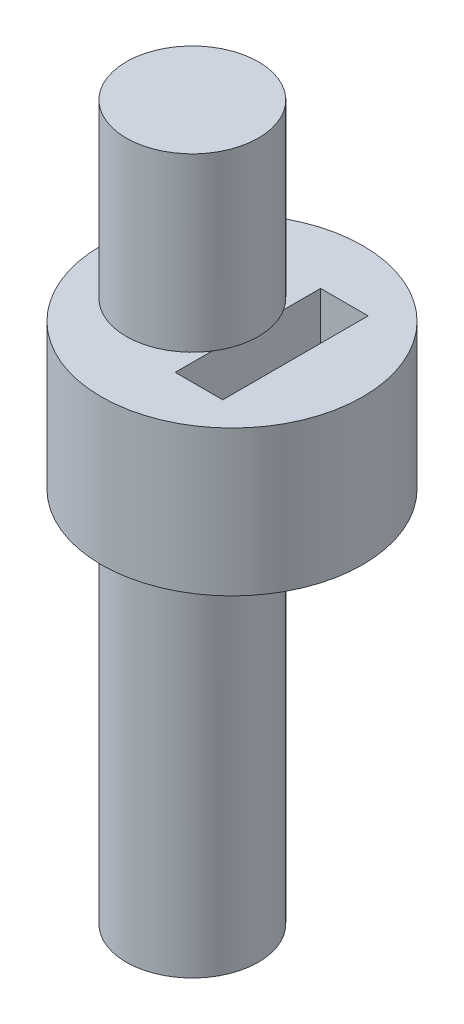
ISO-10303-21;
HEADER;
FILE_DESCRIPTION(('STEP AP214'),'2;1');
FILE_NAME('part.step','',(''),(''),'','','');
FILE_SCHEMA(('AUTOMOTIVE_DESIGN { 1 0 10303 214 1 1 1 1 }'));
ENDSEC;
DATA;
#1=APPLICATION_CONTEXT('core data for automotive mechanical design processes');
#2=APPLICATION_PROTOCOL_DEFINITION('international standard','automotive_design',2000,#1);
#3=PRODUCT_CONTEXT('',#1,'mechanical');
#4=PRODUCT('Part','Part','',(#3));
#5=PRODUCT_RELATED_PRODUCT_CATEGORY('part','',(#4));
#6=PRODUCT_DEFINITION_FORMATION('','',#4);
#7=PRODUCT_DEFINITION_CONTEXT('part definition',#1,'design');
#8=PRODUCT_DEFINITION('design','',#6,#7);
#9=PRODUCT_DEFINITION_SHAPE('','',#8);
#10=(LENGTH_UNIT() NAMED_UNIT(*) SI_UNIT(.MILLI.,.METRE.));
#11=(NAMED_UNIT(*) PLANE_ANGLE_UNIT() SI_UNIT($,.RADIAN.));
#12=(NAMED_UNIT(*) SI_UNIT($,.STERADIAN.) SOLID_ANGLE_UNIT());
#13=UNCERTAINTY_MEASURE_WITH_UNIT(LENGTH_MEASURE(1.E-05),#10,'distance_accuracy_value','');
#14=(GEOMETRIC_REPRESENTATION_CONTEXT(3) GLOBAL_UNCERTAINTY_ASSIGNED_CONTEXT((#13)) GLOBAL_UNIT_ASSIGNED_CONTEXT((#10,
#11,#12)) REPRESENTATION_CONTEXT('',''));
#15=CARTESIAN_POINT('',(0.,0.,0.));
#16=DIRECTION('',(0.,0.,1.));
#17=DIRECTION('',(1.,0.,0.));
#18=AXIS2_PLACEMENT_3D('',#15,#16,#17);
#19=CARTESIAN_POINT('',(0.,15.,0.));
#20=DIRECTION('',(0.,-1.,0.));
#21=DIRECTION('',(0.,0.,-1.));
#22=AXIS2_PLACEMENT_3D('',#19,#20,#21);
#23=CYLINDRICAL_SURFACE('',#22,2.5);
#24=CARTESIAN_POINT('',(0.,15.,0.));
#25=DIRECTION('',(0.,1.,0.));
#26=DIRECTION('',(0.,0.,1.));
#27=AXIS2_PLACEMENT_3D('',#24,#25,#26);
#28=CIRCLE('',#27,2.5);
#29=CARTESIAN_POINT('',(2.1,15.,1.35646599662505));
#30=VERTEX_POINT('',#29);
#31=CARTESIAN_POINT('',(2.1,15.,-1.35646599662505));
#32=VERTEX_POINT('',#31);
#33=EDGE_CURVE('E139',#30,#32,#28,.T.);
#34=ORIENTED_EDGE('',*,*,#33,.F.);
#35=EDGE_CURVE('E140',#32,#30,#28,.T.);
#36=ORIENTED_EDGE('',*,*,#35,.F.);
#37=EDGE_LOOP('',(#34,#36));
#38=FACE_BOUND('',#37,.T.);
#39=CARTESIAN_POINT('',(0.,0.,0.));
#40=DIRECTION('',(0.,1.,0.));
#41=DIRECTION('',(0.,0.,1.));
#42=AXIS2_PLACEMENT_3D('',#39,#40,#41);
#43=CIRCLE('',#42,2.5);
#44=CARTESIAN_POINT('',(0.,0.,2.5));
#45=VERTEX_POINT('',#44);
#46=EDGE_CURVE('E136',#45,#45,#43,.T.);
#47=ORIENTED_EDGE('',*,*,#46,.T.);
#48=EDGE_LOOP('',(#47));
#49=FACE_BOUND('',#48,.T.);
#50=ADVANCED_FACE('F32',(#38,#49),#23,.T.);
#51=CARTESIAN_POINT('',(0.,0.,0.));
#52=DIRECTION('',(0.,1.,0.));
#53=DIRECTION('',(0.,0.,1.));
#54=AXIS2_PLACEMENT_3D('',#51,#52,#53);
#55=PLANE('',#54);
#56=ORIENTED_EDGE('',*,*,#46,.F.);
#57=EDGE_LOOP('',(#56));
#58=FACE_BOUND('',#57,.T.);
#59=ADVANCED_FACE('F177',(#58),#55,.F.);
#60=CARTESIAN_POINT('',(1.5,20.5,0.));
#61=DIRECTION('',(0.,-1.,0.));
#62=DIRECTION('',(0.,0.,-1.));
#63=AXIS2_PLACEMENT_3D('',#60,#61,#62);
#64=CYLINDRICAL_SURFACE('',#63,4.95);
#65=CARTESIAN_POINT('',(1.5,20.5,0.));
#66=DIRECTION('',(0.,1.,0.));
#67=DIRECTION('',(0.,0.,1.));
#68=AXIS2_PLACEMENT_3D('',#65,#66,#67);
#69=CIRCLE('',#68,4.95);
#70=CARTESIAN_POINT('',(1.5,20.5,4.95));
#71=VERTEX_POINT('',#70);
#72=EDGE_CURVE('E133',#71,#71,#69,.T.);
#73=ORIENTED_EDGE('',*,*,#72,.F.);
#74=EDGE_LOOP('',(#73));
#75=FACE_BOUND('',#74,.T.);
#76=CARTESIAN_POINT('',(1.5,15.,0.));
#77=DIRECTION('',(0.,1.,0.));
#78=DIRECTION('',(0.,0.,1.));
#79=AXIS2_PLACEMENT_3D('',#76,#77,#78);
#80=CIRCLE('',#79,4.95);
#81=CARTESIAN_POINT('',(1.5,15.,4.95));
#82=VERTEX_POINT('',#81);
#83=EDGE_CURVE('E129',#82,#82,#80,.T.);
#84=ORIENTED_EDGE('',*,*,#83,.T.);
#85=EDGE_LOOP('',(#84));
#86=FACE_BOUND('',#85,.T.);
#87=ADVANCED_FACE('F181',(#75,#86),#64,.T.);
#88=CARTESIAN_POINT('',(1.5,20.5,0.));
#89=DIRECTION('',(0.,1.,0.));
#90=DIRECTION('',(0.,0.,1.));
#91=AXIS2_PLACEMENT_3D('',#88,#89,#90);
#92=PLANE('',#91);
#93=DIRECTION('',(0.,0.,-1.));
#94=VECTOR('',#93,1.);
#95=CARTESIAN_POINT('',(2.1,20.5,2.75));
#96=LINE('',#95,#94);
#97=CARTESIAN_POINT('',(2.1,20.5,2.75));
#98=VERTEX_POINT('',#97);
#99=CARTESIAN_POINT('',(2.1,20.5,1.35646599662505));
#100=VERTEX_POINT('',#99);
#101=EDGE_CURVE('E85',#98,#100,#96,.T.);
#102=ORIENTED_EDGE('',*,*,#101,.T.);
#103=CARTESIAN_POINT('',(0.,20.5,0.));
#104=DIRECTION('',(0.,1.,0.));
#105=DIRECTION('',(0.,0.,1.));
#106=AXIS2_PLACEMENT_3D('',#103,#104,#105);
#107=CIRCLE('',#106,2.5);
#108=CARTESIAN_POINT('',(2.1,20.5,-1.35646599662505));
#109=VERTEX_POINT('',#108);
#110=EDGE_CURVE('E132',#109,#100,#107,.T.);
#111=ORIENTED_EDGE('',*,*,#110,.F.);
#112=CARTESIAN_POINT('',(2.1,20.5,-2.75));
#113=VERTEX_POINT('',#112);
#114=EDGE_CURVE('E97',#109,#113,#96,.T.);
#115=ORIENTED_EDGE('',*,*,#114,.T.);
#116=DIRECTION('',(1.,0.,0.));
#117=VECTOR('',#116,1.);
#118=CARTESIAN_POINT('',(2.1,20.5,-2.75));
#119=LINE('',#118,#117);
#120=CARTESIAN_POINT('',(3.9,20.5,-2.75));
#121=VERTEX_POINT('',#120);
#122=EDGE_CURVE('E121',#113,#121,#119,.T.);
#123=ORIENTED_EDGE('',*,*,#122,.T.);
#124=DIRECTION('',(0.,0.,1.));
#125=VECTOR('',#124,1.);
#126=CARTESIAN_POINT('',(3.9,20.5,2.75));
#127=LINE('',#126,#125);
#128=CARTESIAN_POINT('',(3.9,20.5,2.75));
#129=VERTEX_POINT('',#128);
#130=EDGE_CURVE('E110',#121,#129,#127,.T.);
#131=ORIENTED_EDGE('',*,*,#130,.T.);
#132=DIRECTION('',(-1.,0.,0.));
#133=VECTOR('',#132,1.);
#134=CARTESIAN_POINT('',(2.1,20.5,2.75));
#135=LINE('',#134,#133);
#136=EDGE_CURVE('E100',#129,#98,#135,.T.);
#137=ORIENTED_EDGE('',*,*,#136,.T.);
#138=EDGE_LOOP('',(#102,#111,#115,#123,#131,#137));
#139=FACE_BOUND('',#138,.T.);
#140=ORIENTED_EDGE('',*,*,#72,.T.);
#141=EDGE_LOOP('',(#140));
#142=FACE_BOUND('',#141,.T.);
#143=ADVANCED_FACE('F107',(#139,#142),#92,.T.);
#144=CARTESIAN_POINT('',(1.5,15.,0.));
#145=DIRECTION('',(0.,1.,0.));
#146=DIRECTION('',(0.,0.,1.));
#147=AXIS2_PLACEMENT_3D('',#144,#145,#146);
#148=PLANE('',#147);
#149=ORIENTED_EDGE('',*,*,#35,.T.);
#150=DIRECTION('',(0.,0.,-1.));
#151=VECTOR('',#150,1.);
#152=CARTESIAN_POINT('',(2.1,15.,2.75));
#153=LINE('',#152,#151);
#154=CARTESIAN_POINT('',(2.1,15.,2.75));
#155=VERTEX_POINT('',#154);
#156=EDGE_CURVE('E112',#155,#30,#153,.T.);
#157=ORIENTED_EDGE('',*,*,#156,.F.);
#158=DIRECTION('',(-1.,0.,0.));
#159=VECTOR('',#158,1.);
#160=CARTESIAN_POINT('',(2.1,15.,2.75));
#161=LINE('',#160,#159);
#162=CARTESIAN_POINT('',(3.9,15.,2.75));
#163=VERTEX_POINT('',#162);
#164=EDGE_CURVE('E103',#163,#155,#161,.T.);
#165=ORIENTED_EDGE('',*,*,#164,.F.);
#166=DIRECTION('',(0.,0.,1.));
#167=VECTOR('',#166,1.);
#168=CARTESIAN_POINT('',(3.9,15.,2.75));
#169=LINE('',#168,#167);
#170=CARTESIAN_POINT('',(3.9,15.,-2.75));
#171=VERTEX_POINT('',#170);
#172=EDGE_CURVE('E116',#171,#163,#169,.T.);
#173=ORIENTED_EDGE('',*,*,#172,.F.);
#174=DIRECTION('',(1.,0.,0.));
#175=VECTOR('',#174,1.);
#176=CARTESIAN_POINT('',(2.1,15.,-2.75));
#177=LINE('',#176,#175);
#178=CARTESIAN_POINT('',(2.1,15.,-2.75));
#179=VERTEX_POINT('',#178);
#180=EDGE_CURVE('E46',#179,#171,#177,.T.);
#181=ORIENTED_EDGE('',*,*,#180,.F.);
#182=DIRECTION('',(0.,0.,1.));
#183=VECTOR('',#182,1.);
#184=CARTESIAN_POINT('',(2.1,15.,0.));
#185=LINE('',#184,#183);
#186=EDGE_CURVE('E11',#179,#32,#185,.T.);
#187=ORIENTED_EDGE('',*,*,#186,.T.);
#188=EDGE_LOOP('',(#149,#157,#165,#173,#181,#187));
#189=FACE_BOUND('',#188,.T.);
#190=ORIENTED_EDGE('',*,*,#83,.F.);
#191=EDGE_LOOP('',(#190));
#192=FACE_BOUND('',#191,.T.);
#193=ADVANCED_FACE('F148',(#189,#192),#148,.F.);
#194=CARTESIAN_POINT('',(0.,27.,0.));
#195=DIRECTION('',(0.,-1.,0.));
#196=DIRECTION('',(0.,0.,-1.));
#197=AXIS2_PLACEMENT_3D('',#194,#195,#196);
#198=CYLINDRICAL_SURFACE('',#197,2.5);
#199=CARTESIAN_POINT('',(0.,27.,0.));
#200=DIRECTION('',(0.,1.,0.));
#201=DIRECTION('',(0.,0.,1.));
#202=AXIS2_PLACEMENT_3D('',#199,#200,#201);
#203=CIRCLE('',#202,2.5);
#204=CARTESIAN_POINT('',(0.,27.,2.5));
#205=VERTEX_POINT('',#204);
#206=EDGE_CURVE('E126',#205,#205,#203,.T.);
#207=ORIENTED_EDGE('',*,*,#206,.F.);
#208=EDGE_LOOP('',(#207));
#209=FACE_BOUND('',#208,.T.);
#210=EDGE_CURVE('E39',#100,#109,#107,.T.);
#211=ORIENTED_EDGE('',*,*,#210,.T.);
#212=ORIENTED_EDGE('',*,*,#110,.T.);
#213=EDGE_LOOP('',(#211,#212));
#214=FACE_BOUND('',#213,.T.);
#215=ADVANCED_FACE('F164',(#209,#214),#198,.T.);
#216=CARTESIAN_POINT('',(0.,27.,0.));
#217=DIRECTION('',(0.,1.,0.));
#218=DIRECTION('',(0.,0.,1.));
#219=AXIS2_PLACEMENT_3D('',#216,#217,#218);
#220=PLANE('',#219);
#221=ORIENTED_EDGE('',*,*,#206,.T.);
#222=EDGE_LOOP('',(#221));
#223=FACE_BOUND('',#222,.T.);
#224=ADVANCED_FACE('F173',(#223),#220,.T.);
#225=CARTESIAN_POINT('',(0.,15.,0.));
#226=DIRECTION('',(0.,-1.,0.));
#227=DIRECTION('',(0.,0.,-1.));
#228=AXIS2_PLACEMENT_3D('',#225,#226,#227);
#229=PLANE('',#228);
#230=EDGE_CURVE('E154',#30,#32,#153,.T.);
#231=ORIENTED_EDGE('',*,*,#230,.F.);
#232=ORIENTED_EDGE('',*,*,#33,.T.);
#233=EDGE_LOOP('',(#231,#232));
#234=FACE_BOUND('',#233,.T.);
#235=ADVANCED_FACE('F153',(#234),#229,.F.);
#236=CARTESIAN_POINT('',(1.5,20.5,0.));
#237=DIRECTION('',(0.,1.,0.));
#238=DIRECTION('',(0.,0.,1.));
#239=AXIS2_PLACEMENT_3D('',#236,#237,#238);
#240=PLANE('',#239);
#241=EDGE_CURVE('E53',#100,#109,#96,.T.);
#242=ORIENTED_EDGE('',*,*,#241,.T.);
#243=ORIENTED_EDGE('',*,*,#210,.F.);
#244=EDGE_LOOP('',(#242,#243));
#245=FACE_BOUND('',#244,.T.);
#246=ADVANCED_FACE('F165',(#245),#240,.F.);
#247=CARTESIAN_POINT('',(2.1,26.2870545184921,2.75));
#248=DIRECTION('',(0.,0.,1.));
#249=DIRECTION('',(1.,0.,0.));
#250=AXIS2_PLACEMENT_3D('',#247,#248,#249);
#251=PLANE('',#250);
#252=DIRECTION('',(0.,-1.,0.));
#253=VECTOR('',#252,1.);
#254=CARTESIAN_POINT('',(3.9,26.2870545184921,2.75));
#255=LINE('',#254,#253);
#256=EDGE_CURVE('E119',#129,#163,#255,.T.);
#257=ORIENTED_EDGE('',*,*,#256,.T.);
#258=ORIENTED_EDGE('',*,*,#164,.T.);
#259=DIRECTION('',(0.,-1.,0.));
#260=VECTOR('',#259,1.);
#261=CARTESIAN_POINT('',(2.1,26.2870545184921,2.75));
#262=LINE('',#261,#260);
#263=EDGE_CURVE('E89',#98,#155,#262,.T.);
#264=ORIENTED_EDGE('',*,*,#263,.F.);
#265=ORIENTED_EDGE('',*,*,#136,.F.);
#266=EDGE_LOOP('',(#257,#258,#264,#265));
#267=FACE_BOUND('',#266,.T.);
#268=ADVANCED_FACE('F99',(#267),#251,.F.);
#269=CARTESIAN_POINT('',(2.1,26.2870545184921,2.75));
#270=DIRECTION('',(-1.,0.,0.));
#271=DIRECTION('',(0.,0.,1.));
#272=AXIS2_PLACEMENT_3D('',#269,#270,#271);
#273=PLANE('',#272);
#274=ORIENTED_EDGE('',*,*,#263,.T.);
#275=ORIENTED_EDGE('',*,*,#156,.T.);
#276=ORIENTED_EDGE('',*,*,#230,.T.);
#277=ORIENTED_EDGE('',*,*,#186,.F.);
#278=DIRECTION('',(0.,-1.,0.));
#279=VECTOR('',#278,1.);
#280=CARTESIAN_POINT('',(2.1,26.2870545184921,-2.75));
#281=LINE('',#280,#279);
#282=EDGE_CURVE('E95',#113,#179,#281,.T.);
#283=ORIENTED_EDGE('',*,*,#282,.F.);
#284=ORIENTED_EDGE('',*,*,#114,.F.);
#285=ORIENTED_EDGE('',*,*,#241,.F.);
#286=ORIENTED_EDGE('',*,*,#101,.F.);
#287=EDGE_LOOP('',(#274,#275,#276,#277,#283,#284,#285,#286));
#288=FACE_BOUND('',#287,.T.);
#289=ADVANCED_FACE('F87',(#288),#273,.F.);
#290=CARTESIAN_POINT('',(2.1,26.2870545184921,-2.75));
#291=DIRECTION('',(0.,0.,-1.));
#292=DIRECTION('',(-1.,0.,0.));
#293=AXIS2_PLACEMENT_3D('',#290,#291,#292);
#294=PLANE('',#293);
#295=ORIENTED_EDGE('',*,*,#282,.T.);
#296=ORIENTED_EDGE('',*,*,#180,.T.);
#297=DIRECTION('',(0.,-1.,0.));
#298=VECTOR('',#297,1.);
#299=CARTESIAN_POINT('',(3.9,26.2870545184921,-2.75));
#300=LINE('',#299,#298);
#301=EDGE_CURVE('E120',#121,#171,#300,.T.);
#302=ORIENTED_EDGE('',*,*,#301,.F.);
#303=ORIENTED_EDGE('',*,*,#122,.F.);
#304=EDGE_LOOP('',(#295,#296,#302,#303));
#305=FACE_BOUND('',#304,.T.);
#306=ADVANCED_FACE('F161',(#305),#294,.F.);
#307=CARTESIAN_POINT('',(3.9,26.2870545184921,2.75));
#308=DIRECTION('',(1.,0.,0.));
#309=DIRECTION('',(0.,0.,-1.));
#310=AXIS2_PLACEMENT_3D('',#307,#308,#309);
#311=PLANE('',#310);
#312=ORIENTED_EDGE('',*,*,#301,.T.);
#313=ORIENTED_EDGE('',*,*,#172,.T.);
#314=ORIENTED_EDGE('',*,*,#256,.F.);
#315=ORIENTED_EDGE('',*,*,#130,.F.);
#316=EDGE_LOOP('',(#312,#313,#314,#315));
#317=FACE_BOUND('',#316,.T.);
#318=ADVANCED_FACE('F160',(#317),#311,.F.);
#319=CLOSED_SHELL('',(#50,#59,#87,#143,#193,#215,#224,#235,#246,#268,#289,#306,#318));
#320=MANIFOLD_SOLID_BREP('B2',#319);
#321=ADVANCED_BREP_SHAPE_REPRESENTATION('',(#18,#320),#14);
#322=SHAPE_DEFINITION_REPRESENTATION(#9,#321);
ENDSEC;
END-ISO-10303-21;
